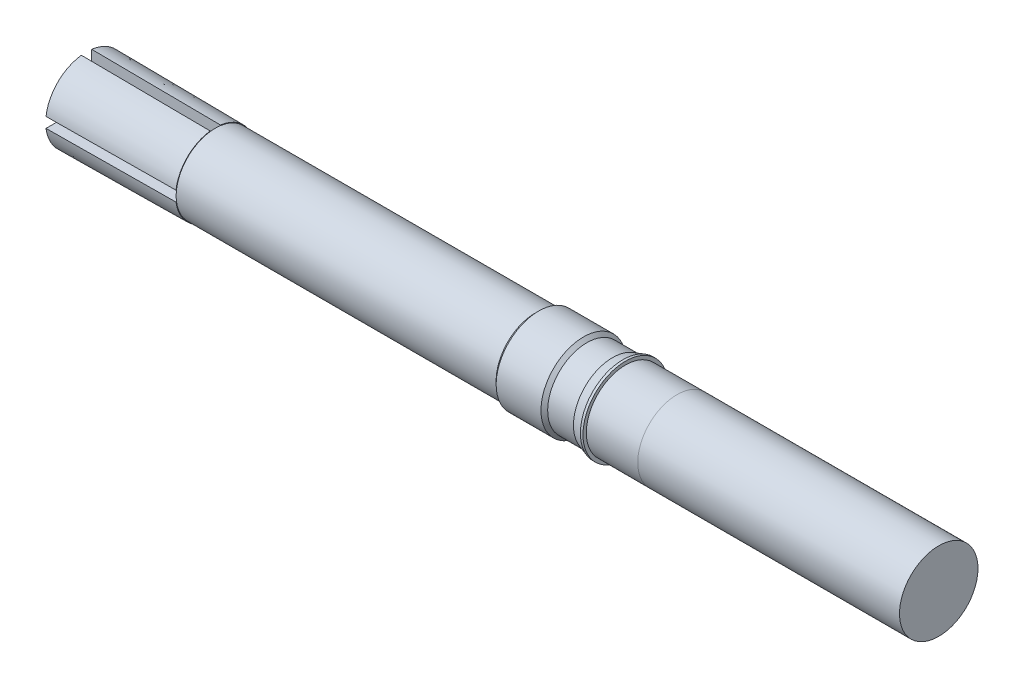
ISO-10303-21;
HEADER;
FILE_DESCRIPTION(('STEP AP214'),'2;1');
FILE_NAME('part.step','',(''),(''),'','','');
FILE_SCHEMA(('AUTOMOTIVE_DESIGN { 1 0 10303 214 1 1 1 1 }'));
ENDSEC;
DATA;
#1=APPLICATION_CONTEXT('core data for automotive mechanical design processes');
#2=APPLICATION_PROTOCOL_DEFINITION('international standard','automotive_design',2000,#1);
#3=PRODUCT_CONTEXT('',#1,'mechanical');
#4=PRODUCT('Part','Part','',(#3));
#5=PRODUCT_RELATED_PRODUCT_CATEGORY('part','',(#4));
#6=PRODUCT_DEFINITION_FORMATION('','',#4);
#7=PRODUCT_DEFINITION_CONTEXT('part definition',#1,'design');
#8=PRODUCT_DEFINITION('design','',#6,#7);
#9=PRODUCT_DEFINITION_SHAPE('','',#8);
#10=(LENGTH_UNIT() NAMED_UNIT(*) SI_UNIT(.MILLI.,.METRE.));
#11=(NAMED_UNIT(*) PLANE_ANGLE_UNIT() SI_UNIT($,.RADIAN.));
#12=(NAMED_UNIT(*) SI_UNIT($,.STERADIAN.) SOLID_ANGLE_UNIT());
#13=UNCERTAINTY_MEASURE_WITH_UNIT(LENGTH_MEASURE(1.E-05),#10,'distance_accuracy_value','');
#14=(GEOMETRIC_REPRESENTATION_CONTEXT(3) GLOBAL_UNCERTAINTY_ASSIGNED_CONTEXT((#13)) GLOBAL_UNIT_ASSIGNED_CONTEXT((#10,
#11,#12)) REPRESENTATION_CONTEXT('',''));
#15=CARTESIAN_POINT('',(0.,0.,0.));
#16=DIRECTION('',(0.,0.,1.));
#17=DIRECTION('',(1.,0.,0.));
#18=AXIS2_PLACEMENT_3D('',#15,#16,#17);
#19=CARTESIAN_POINT('',(10.9794,0.,0.));
#20=DIRECTION('',(-1.,0.,0.));
#21=DIRECTION('',(0.,-1.,0.));
#22=AXIS2_PLACEMENT_3D('',#19,#20,#21);
#23=PLANE('',#22);
#24=CARTESIAN_POINT('',(10.9794,0.,0.));
#25=DIRECTION('',(-1.,0.,0.));
#26=DIRECTION('',(0.,-1.,0.));
#27=AXIS2_PLACEMENT_3D('',#24,#25,#26);
#28=CIRCLE('',#27,1.52);
#29=CARTESIAN_POINT('',(10.9794,-0.199999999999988,1.50678465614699));
#30=VERTEX_POINT('',#29);
#31=CARTESIAN_POINT('',(10.9794,0.200000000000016,1.50678465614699));
#32=VERTEX_POINT('',#31);
#33=EDGE_CURVE('E227',#30,#32,#28,.T.);
#34=ORIENTED_EDGE('',*,*,#33,.T.);
#35=DIRECTION('',(0.,0.,1.));
#36=VECTOR('',#35,1.);
#37=CARTESIAN_POINT('',(10.9794,0.200000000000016,1.52695775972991));
#38=LINE('',#37,#36);
#39=CARTESIAN_POINT('',(10.9794,0.200000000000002,0.2));
#40=VERTEX_POINT('',#39);
#41=EDGE_CURVE('E57',#40,#32,#38,.T.);
#42=ORIENTED_EDGE('',*,*,#41,.F.);
#43=DIRECTION('',(0.,-1.,0.));
#44=VECTOR('',#43,1.);
#45=CARTESIAN_POINT('',(10.9794,0.200000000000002,0.2));
#46=LINE('',#45,#44);
#47=CARTESIAN_POINT('',(10.9794,1.50678465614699,0.2));
#48=VERTEX_POINT('',#47);
#49=EDGE_CURVE('E307',#48,#40,#46,.T.);
#50=ORIENTED_EDGE('',*,*,#49,.F.);
#51=CARTESIAN_POINT('',(10.9794,1.50678465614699,-0.2));
#52=VERTEX_POINT('',#51);
#53=EDGE_CURVE('E130',#48,#52,#28,.T.);
#54=ORIENTED_EDGE('',*,*,#53,.T.);
#55=DIRECTION('',(0.,1.,0.));
#56=VECTOR('',#55,1.);
#57=CARTESIAN_POINT('',(10.9794,1.52695775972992,-0.2));
#58=LINE('',#57,#56);
#59=CARTESIAN_POINT('',(10.9794,0.199999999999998,-0.2));
#60=VERTEX_POINT('',#59);
#61=EDGE_CURVE('E124',#60,#52,#58,.T.);
#62=ORIENTED_EDGE('',*,*,#61,.F.);
#63=DIRECTION('',(0.,0.,1.));
#64=VECTOR('',#63,1.);
#65=CARTESIAN_POINT('',(10.9794,0.199999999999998,-0.2));
#66=LINE('',#65,#64);
#67=CARTESIAN_POINT('',(10.9794,0.199999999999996,-1.50678465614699));
#68=VERTEX_POINT('',#67);
#69=EDGE_CURVE('E127',#68,#60,#66,.T.);
#70=ORIENTED_EDGE('',*,*,#69,.F.);
#71=CARTESIAN_POINT('',(10.9794,-0.200000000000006,-1.50678465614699));
#72=VERTEX_POINT('',#71);
#73=EDGE_CURVE('E327',#68,#72,#28,.T.);
#74=ORIENTED_EDGE('',*,*,#73,.T.);
#75=DIRECTION('',(0.,0.,-1.));
#76=VECTOR('',#75,1.);
#77=CARTESIAN_POINT('',(10.9794,-0.200000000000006,-1.52695775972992));
#78=LINE('',#77,#76);
#79=CARTESIAN_POINT('',(10.9794,-0.200000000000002,-0.2));
#80=VERTEX_POINT('',#79);
#81=EDGE_CURVE('E172',#80,#72,#78,.T.);
#82=ORIENTED_EDGE('',*,*,#81,.F.);
#83=DIRECTION('',(0.,1.,0.));
#84=VECTOR('',#83,1.);
#85=CARTESIAN_POINT('',(10.9794,-0.200000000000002,-0.2));
#86=LINE('',#85,#84);
#87=CARTESIAN_POINT('',(10.9794,-1.50678465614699,-0.2));
#88=VERTEX_POINT('',#87);
#89=EDGE_CURVE('E179',#88,#80,#86,.T.);
#90=ORIENTED_EDGE('',*,*,#89,.F.);
#91=CARTESIAN_POINT('',(10.9794,-1.50678465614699,0.2));
#92=VERTEX_POINT('',#91);
#93=EDGE_CURVE('E224',#88,#92,#28,.T.);
#94=ORIENTED_EDGE('',*,*,#93,.T.);
#95=DIRECTION('',(0.,-1.,0.));
#96=VECTOR('',#95,1.);
#97=CARTESIAN_POINT('',(10.9794,-1.52695775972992,0.2));
#98=LINE('',#97,#96);
#99=CARTESIAN_POINT('',(10.9794,-0.199999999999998,0.2));
#100=VERTEX_POINT('',#99);
#101=EDGE_CURVE('E103',#100,#92,#98,.T.);
#102=ORIENTED_EDGE('',*,*,#101,.F.);
#103=DIRECTION('',(0.,0.,-1.));
#104=VECTOR('',#103,1.);
#105=CARTESIAN_POINT('',(10.9794,-0.199999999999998,0.2));
#106=LINE('',#105,#104);
#107=EDGE_CURVE('E11',#30,#100,#106,.T.);
#108=ORIENTED_EDGE('',*,*,#107,.F.);
#109=EDGE_LOOP('',(#34,#42,#50,#54,#62,#70,#74,#82,#90,#94,#102,#108));
#110=FACE_BOUND('',#109,.T.);
#111=ADVANCED_FACE('F34',(#110),#23,.T.);
#112=CARTESIAN_POINT('',(28.9,0.,0.));
#113=DIRECTION('',(-1.,0.,0.));
#114=DIRECTION('',(0.,-1.,0.));
#115=AXIS2_PLACEMENT_3D('',#112,#113,#114);
#116=CYLINDRICAL_SURFACE('',#115,1.52);
#117=CARTESIAN_POINT('',(23.4,0.,0.));
#118=DIRECTION('',(-1.,0.,0.));
#119=DIRECTION('',(0.,-1.,0.));
#120=AXIS2_PLACEMENT_3D('',#117,#118,#119);
#121=CIRCLE('',#120,1.52);
#122=CARTESIAN_POINT('',(23.4,-1.52,0.));
#123=VERTEX_POINT('',#122);
#124=EDGE_CURVE('E221',#123,#123,#121,.T.);
#125=ORIENTED_EDGE('',*,*,#124,.T.);
#126=EDGE_LOOP('',(#125));
#127=FACE_BOUND('',#126,.T.);
#128=EDGE_CURVE('E47',#92,#30,#28,.T.);
#129=ORIENTED_EDGE('',*,*,#128,.F.);
#130=ORIENTED_EDGE('',*,*,#93,.F.);
#131=EDGE_CURVE('E329',#72,#88,#28,.T.);
#132=ORIENTED_EDGE('',*,*,#131,.F.);
#133=ORIENTED_EDGE('',*,*,#73,.F.);
#134=EDGE_CURVE('E322',#52,#68,#28,.T.);
#135=ORIENTED_EDGE('',*,*,#134,.F.);
#136=ORIENTED_EDGE('',*,*,#53,.F.);
#137=EDGE_CURVE('E328',#32,#48,#28,.T.);
#138=ORIENTED_EDGE('',*,*,#137,.F.);
#139=ORIENTED_EDGE('',*,*,#33,.F.);
#140=EDGE_LOOP('',(#129,#130,#132,#133,#135,#136,#138,#139));
#141=FACE_BOUND('',#140,.T.);
#142=ADVANCED_FACE('F426',(#127,#141),#116,.T.);
#143=CARTESIAN_POINT('',(23.4,0.,0.));
#144=DIRECTION('',(1.,0.,0.));
#145=DIRECTION('',(0.,1.,0.));
#146=AXIS2_PLACEMENT_3D('',#143,#144,#145);
#147=CONICAL_SURFACE('',#146,1.52,0.785398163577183);
#148=CARTESIAN_POINT('',(23.5299999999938,0.,0.));
#149=DIRECTION('',(-1.,0.,0.));
#150=DIRECTION('',(0.,-1.,0.));
#151=AXIS2_PLACEMENT_3D('',#148,#149,#150);
#152=CIRCLE('',#151,1.65000000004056);
#153=CARTESIAN_POINT('',(23.5299999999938,-1.65000000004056,0.));
#154=VERTEX_POINT('',#153);
#155=EDGE_CURVE('E218',#154,#154,#152,.T.);
#156=ORIENTED_EDGE('',*,*,#155,.T.);
#157=EDGE_LOOP('',(#156));
#158=FACE_BOUND('',#157,.T.);
#159=ORIENTED_EDGE('',*,*,#124,.F.);
#160=EDGE_LOOP('',(#159));
#161=FACE_BOUND('',#160,.T.);
#162=ADVANCED_FACE('F423',(#158,#161),#147,.T.);
#163=CARTESIAN_POINT('',(28.9,0.,0.));
#164=DIRECTION('',(-1.,0.,0.));
#165=DIRECTION('',(0.,-1.,0.));
#166=AXIS2_PLACEMENT_3D('',#163,#164,#165);
#167=CYLINDRICAL_SURFACE('',#166,1.65000000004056);
#168=CARTESIAN_POINT('',(25.27,0.,0.));
#169=DIRECTION('',(-1.,0.,0.));
#170=DIRECTION('',(0.,-1.,0.));
#171=AXIS2_PLACEMENT_3D('',#168,#169,#170);
#172=CIRCLE('',#171,1.65000000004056);
#173=CARTESIAN_POINT('',(25.27,-1.65000000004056,0.));
#174=VERTEX_POINT('',#173);
#175=EDGE_CURVE('E215',#174,#174,#172,.T.);
#176=ORIENTED_EDGE('',*,*,#175,.T.);
#177=EDGE_LOOP('',(#176));
#178=FACE_BOUND('',#177,.T.);
#179=ORIENTED_EDGE('',*,*,#155,.F.);
#180=EDGE_LOOP('',(#179));
#181=FACE_BOUND('',#180,.T.);
#182=ADVANCED_FACE('F419',(#178,#181),#167,.T.);
#183=CARTESIAN_POINT('',(25.27,0.,0.));
#184=DIRECTION('',(-1.,0.,0.));
#185=DIRECTION('',(0.,-1.,0.));
#186=AXIS2_PLACEMENT_3D('',#183,#184,#185);
#187=CONICAL_SURFACE('',#186,1.65000000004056,0.785398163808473);
#188=CARTESIAN_POINT('',(25.3999999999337,0.,0.));
#189=DIRECTION('',(-1.,0.,0.));
#190=DIRECTION('',(0.,-1.,0.));
#191=AXIS2_PLACEMENT_3D('',#188,#189,#190);
#192=CIRCLE('',#191,1.52);
#193=CARTESIAN_POINT('',(25.3999999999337,-1.52,0.));
#194=VERTEX_POINT('',#193);
#195=EDGE_CURVE('E212',#194,#194,#192,.T.);
#196=ORIENTED_EDGE('',*,*,#195,.T.);
#197=EDGE_LOOP('',(#196));
#198=FACE_BOUND('',#197,.T.);
#199=ORIENTED_EDGE('',*,*,#175,.F.);
#200=EDGE_LOOP('',(#199));
#201=FACE_BOUND('',#200,.T.);
#202=ADVANCED_FACE('F415',(#198,#201),#187,.T.);
#203=CARTESIAN_POINT('',(28.9,0.,0.));
#204=DIRECTION('',(-1.,0.,0.));
#205=DIRECTION('',(0.,-1.,0.));
#206=AXIS2_PLACEMENT_3D('',#203,#204,#205);
#207=CYLINDRICAL_SURFACE('',#206,1.52);
#208=CARTESIAN_POINT('',(26.4,0.,0.));
#209=DIRECTION('',(-1.,0.,0.));
#210=DIRECTION('',(0.,-1.,0.));
#211=AXIS2_PLACEMENT_3D('',#208,#209,#210);
#212=CIRCLE('',#211,1.52);
#213=CARTESIAN_POINT('',(26.4,-1.52,0.));
#214=VERTEX_POINT('',#213);
#215=EDGE_CURVE('E209',#214,#214,#212,.T.);
#216=ORIENTED_EDGE('',*,*,#215,.T.);
#217=EDGE_LOOP('',(#216));
#218=FACE_BOUND('',#217,.T.);
#219=ORIENTED_EDGE('',*,*,#195,.F.);
#220=EDGE_LOOP('',(#219));
#221=FACE_BOUND('',#220,.T.);
#222=ADVANCED_FACE('F411',(#218,#221),#207,.T.);
#223=CARTESIAN_POINT('',(26.4,0.,0.));
#224=DIRECTION('',(1.,0.,0.));
#225=DIRECTION('',(0.,1.,0.));
#226=AXIS2_PLACEMENT_3D('',#223,#224,#225);
#227=CONICAL_SURFACE('',#226,1.52,0.314231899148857);
#228=CARTESIAN_POINT('',(26.800000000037,0.,0.));
#229=DIRECTION('',(-1.,0.,0.));
#230=DIRECTION('',(0.,-1.,0.));
#231=AXIS2_PLACEMENT_3D('',#228,#229,#230);
#232=CIRCLE('',#231,1.65000000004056);
#233=CARTESIAN_POINT('',(26.800000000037,-1.65000000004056,0.));
#234=VERTEX_POINT('',#233);
#235=EDGE_CURVE('E206',#234,#234,#232,.T.);
#236=ORIENTED_EDGE('',*,*,#235,.T.);
#237=EDGE_LOOP('',(#236));
#238=FACE_BOUND('',#237,.T.);
#239=ORIENTED_EDGE('',*,*,#215,.F.);
#240=EDGE_LOOP('',(#239));
#241=FACE_BOUND('',#240,.T.);
#242=ADVANCED_FACE('F407',(#238,#241),#227,.T.);
#243=CARTESIAN_POINT('',(28.9,0.,0.));
#244=DIRECTION('',(-1.,0.,0.));
#245=DIRECTION('',(0.,-1.,0.));
#246=AXIS2_PLACEMENT_3D('',#243,#244,#245);
#247=CYLINDRICAL_SURFACE('',#246,1.65000000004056);
#248=CARTESIAN_POINT('',(26.9,0.,0.));
#249=DIRECTION('',(-1.,0.,0.));
#250=DIRECTION('',(0.,-1.,0.));
#251=AXIS2_PLACEMENT_3D('',#248,#249,#250);
#252=CIRCLE('',#251,1.65000000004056);
#253=CARTESIAN_POINT('',(26.9,-1.65000000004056,0.));
#254=VERTEX_POINT('',#253);
#255=EDGE_CURVE('E202',#254,#254,#252,.T.);
#256=ORIENTED_EDGE('',*,*,#255,.T.);
#257=EDGE_LOOP('',(#256));
#258=FACE_BOUND('',#257,.T.);
#259=ORIENTED_EDGE('',*,*,#235,.F.);
#260=EDGE_LOOP('',(#259));
#261=FACE_BOUND('',#260,.T.);
#262=ADVANCED_FACE('F403',(#258,#261),#247,.T.);
#263=CARTESIAN_POINT('',(26.9,1.65000000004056,0.));
#264=DIRECTION('',(1.,0.,0.));
#265=DIRECTION('',(0.,1.,0.));
#266=AXIS2_PLACEMENT_3D('',#263,#264,#265);
#267=PLANE('',#266);
#268=CARTESIAN_POINT('',(26.9,0.,0.));
#269=DIRECTION('',(-1.,0.,0.));
#270=DIRECTION('',(0.,-1.,0.));
#271=AXIS2_PLACEMENT_3D('',#268,#269,#270);
#272=CIRCLE('',#271,1.52);
#273=CARTESIAN_POINT('',(26.9,-1.52,0.));
#274=VERTEX_POINT('',#273);
#275=EDGE_CURVE('E199',#274,#274,#272,.T.);
#276=ORIENTED_EDGE('',*,*,#275,.T.);
#277=EDGE_LOOP('',(#276));
#278=FACE_BOUND('',#277,.T.);
#279=ORIENTED_EDGE('',*,*,#255,.F.);
#280=EDGE_LOOP('',(#279));
#281=FACE_BOUND('',#280,.T.);
#282=ADVANCED_FACE('F399',(#278,#281),#267,.T.);
#283=CARTESIAN_POINT('',(28.9,0.,0.));
#284=DIRECTION('',(-1.,0.,0.));
#285=DIRECTION('',(0.,-1.,0.));
#286=AXIS2_PLACEMENT_3D('',#283,#284,#285);
#287=CYLINDRICAL_SURFACE('',#286,1.52);
#288=CARTESIAN_POINT('',(28.9,0.,0.));
#289=DIRECTION('',(1.,0.,0.));
#290=DIRECTION('',(0.,0.,-1.));
#291=AXIS2_PLACEMENT_3D('',#288,#289,#290);
#292=CIRCLE('',#291,1.524);
#293=CARTESIAN_POINT('',(28.9,0.,-1.524));
#294=VERTEX_POINT('',#293);
#295=EDGE_CURVE('E688',#294,#294,#292,.T.);
#296=ORIENTED_EDGE('',*,*,#295,.F.);
#297=EDGE_LOOP('',(#296));
#298=FACE_BOUND('',#297,.T.);
#299=ORIENTED_EDGE('',*,*,#275,.F.);
#300=EDGE_LOOP('',(#299));
#301=FACE_BOUND('',#300,.T.);
#302=ADVANCED_FACE('F392',(#298,#301),#287,.T.);
#303=CARTESIAN_POINT('',(5.9794,-1.52695775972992,0.2));
#304=DIRECTION('',(0.,0.,1.));
#305=DIRECTION('',(0.,-1.,0.));
#306=AXIS2_PLACEMENT_3D('',#303,#304,#305);
#307=PLANE('',#306);
#308=ORIENTED_EDGE('',*,*,#101,.T.);
#309=CARTESIAN_POINT('',(10.9794,-1.52695775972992,0.2));
#310=VERTEX_POINT('',#309);
#311=EDGE_CURVE('E193',#92,#310,#98,.T.);
#312=ORIENTED_EDGE('',*,*,#311,.T.);
#313=CARTESIAN_POINT('',(10.9794,-1.52695775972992,0.2));
#314=CARTESIAN_POINT('',(9.96193246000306,-1.53619306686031,0.2));
#315=CARTESIAN_POINT('',(8.94446490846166,-1.54542710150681,0.2));
#316=CARTESIAN_POINT('',(3.85712709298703,-1.59159091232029,0.2));
#317=CARTESIAN_POINT('',(-0.212743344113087,-1.62850160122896,0.2));
#318=CARTESIAN_POINT('',(-4.28261396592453,-1.66539193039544,0.2));
#319=B_SPLINE_CURVE_WITH_KNOTS('',3,(#313,#314,#315,#316,#317,#318),.UNSPECIFIED.,.F.,.F.,(4,2,
4),(0.,3.05252835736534,15.2626417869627),.UNSPECIFIED.);
#320=CARTESIAN_POINT('',(5.9794,-1.57233107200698,0.2));
#321=VERTEX_POINT('',#320);
#322=EDGE_CURVE('E203',#321,#310,#319,.F.);
#323=ORIENTED_EDGE('',*,*,#322,.F.);
#324=DIRECTION('',(0.,-1.,0.));
#325=VECTOR('',#324,1.);
#326=CARTESIAN_POINT('',(5.9794,-1.52695775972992,0.2));
#327=LINE('',#326,#325);
#328=CARTESIAN_POINT('',(5.9794,-0.199999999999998,0.2));
#329=VERTEX_POINT('',#328);
#330=EDGE_CURVE('E185',#329,#321,#327,.T.);
#331=ORIENTED_EDGE('',*,*,#330,.F.);
#332=DIRECTION('',(1.,0.,0.));
#333=VECTOR('',#332,1.);
#334=CARTESIAN_POINT('',(5.9794,-0.199999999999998,0.2));
#335=LINE('',#334,#333);
#336=EDGE_CURVE('E190',#329,#100,#335,.T.);
#337=ORIENTED_EDGE('',*,*,#336,.T.);
#338=EDGE_LOOP('',(#308,#312,#323,#331,#337));
#339=FACE_BOUND('',#338,.T.);
#340=ADVANCED_FACE('F369',(#339),#307,.F.);
#341=CARTESIAN_POINT('',(10.9794,0.,0.));
#342=DIRECTION('',(-1.,0.,0.));
#343=DIRECTION('',(0.,0.,-1.));
#344=AXIS2_PLACEMENT_3D('',#341,#342,#343);
#345=CONICAL_SURFACE('',#344,1.53999999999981,0.00899975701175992);
#346=CARTESIAN_POINT('',(10.9794,0.,0.));
#347=DIRECTION('',(-1.,0.,0.));
#348=DIRECTION('',(0.,0.,-1.));
#349=AXIS2_PLACEMENT_3D('',#346,#347,#348);
#350=CIRCLE('',#349,1.53999999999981);
#351=CARTESIAN_POINT('',(10.9794,-0.199999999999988,1.52695775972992));
#352=VERTEX_POINT('',#351);
#353=EDGE_CURVE('E192',#310,#352,#350,.T.);
#354=ORIENTED_EDGE('',*,*,#353,.T.);
#355=CARTESIAN_POINT('',(5.9794,-0.199999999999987,1.57233107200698));
#356=CARTESIAN_POINT('',(7.02659877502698,-0.199999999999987,1.56283038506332));
#357=CARTESIAN_POINT('',(8.0737975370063,-0.199999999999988,1.55332826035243));
#358=CARTESIAN_POINT('',(9.74046419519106,-0.199999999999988,1.53820288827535));
#359=CARTESIAN_POINT('',(10.3599320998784,-0.199999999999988,1.53258057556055));
#360=CARTESIAN_POINT('',(10.9794,-0.199999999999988,1.52695775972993));
#361=B_SPLINE_CURVE_WITH_KNOTS('',3,(#355,#356,#357,#358,#359,#360),.UNSPECIFIED.,.F.,.F.,(4,2,
4),(0.,3.14172561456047,5.00020586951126),.UNSPECIFIED.);
#362=CARTESIAN_POINT('',(5.9794,-0.199999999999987,1.57233107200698));
#363=VERTEX_POINT('',#362);
#364=EDGE_CURVE('E198',#363,#352,#361,.T.);
#365=ORIENTED_EDGE('',*,*,#364,.F.);
#366=CARTESIAN_POINT('',(5.9794,0.,0.));
#367=DIRECTION('',(1.,0.,0.));
#368=DIRECTION('',(0.,0.,-1.));
#369=AXIS2_PLACEMENT_3D('',#366,#367,#368);
#370=CIRCLE('',#369,1.58499999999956);
#371=EDGE_CURVE('E94',#321,#363,#370,.F.);
#372=ORIENTED_EDGE('',*,*,#371,.F.);
#373=ORIENTED_EDGE('',*,*,#322,.T.);
#374=EDGE_LOOP('',(#354,#365,#372,#373));
#375=FACE_BOUND('',#374,.T.);
#376=ADVANCED_FACE('F36',(#375),#345,.T.);
#377=CARTESIAN_POINT('',(5.9794,-0.199999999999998,0.2));
#378=DIRECTION('',(0.,-1.,0.));
#379=DIRECTION('',(0.,0.,-1.));
#380=AXIS2_PLACEMENT_3D('',#377,#378,#379);
#381=PLANE('',#380);
#382=EDGE_CURVE('E49',#352,#30,#106,.T.);
#383=ORIENTED_EDGE('',*,*,#382,.T.);
#384=ORIENTED_EDGE('',*,*,#107,.T.);
#385=ORIENTED_EDGE('',*,*,#336,.F.);
#386=DIRECTION('',(0.,0.,-1.));
#387=VECTOR('',#386,1.);
#388=CARTESIAN_POINT('',(5.9794,-0.199999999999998,0.2));
#389=LINE('',#388,#387);
#390=EDGE_CURVE('E187',#363,#329,#389,.T.);
#391=ORIENTED_EDGE('',*,*,#390,.F.);
#392=ORIENTED_EDGE('',*,*,#364,.T.);
#393=EDGE_LOOP('',(#383,#384,#385,#391,#392));
#394=FACE_BOUND('',#393,.T.);
#395=ADVANCED_FACE('F393',(#394),#381,.F.);
#396=CARTESIAN_POINT('',(5.9794,0.,0.));
#397=DIRECTION('',(1.,0.,0.));
#398=DIRECTION('',(0.,0.,-1.));
#399=AXIS2_PLACEMENT_3D('',#396,#397,#398);
#400=PLANE('',#399);
#401=ORIENTED_EDGE('',*,*,#330,.T.);
#402=ORIENTED_EDGE('',*,*,#371,.T.);
#403=ORIENTED_EDGE('',*,*,#390,.T.);
#404=EDGE_LOOP('',(#401,#402,#403));
#405=FACE_BOUND('',#404,.T.);
#406=ADVANCED_FACE('F438',(#405),#400,.F.);
#407=CARTESIAN_POINT('',(10.9794,0.,0.));
#408=DIRECTION('',(1.,0.,0.));
#409=DIRECTION('',(0.,0.,-1.));
#410=AXIS2_PLACEMENT_3D('',#407,#408,#409);
#411=PLANE('',#410);
#412=ORIENTED_EDGE('',*,*,#311,.F.);
#413=ORIENTED_EDGE('',*,*,#128,.T.);
#414=ORIENTED_EDGE('',*,*,#382,.F.);
#415=ORIENTED_EDGE('',*,*,#353,.F.);
#416=EDGE_LOOP('',(#412,#413,#414,#415));
#417=FACE_BOUND('',#416,.T.);
#418=ADVANCED_FACE('F374',(#417),#411,.T.);
#419=CARTESIAN_POINT('',(5.9794,-0.200000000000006,-1.52695775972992));
#420=DIRECTION('',(0.,-1.,0.));
#421=DIRECTION('',(0.,0.,-1.));
#422=AXIS2_PLACEMENT_3D('',#419,#420,#421);
#423=PLANE('',#422);
#424=ORIENTED_EDGE('',*,*,#81,.T.);
#425=CARTESIAN_POINT('',(10.9794,-0.200000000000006,-1.52695775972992));
#426=VERTEX_POINT('',#425);
#427=EDGE_CURVE('E176',#72,#426,#78,.T.);
#428=ORIENTED_EDGE('',*,*,#427,.T.);
#429=CARTESIAN_POINT('',(10.9794,-0.200000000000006,-1.52695775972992));
#430=CARTESIAN_POINT('',(9.96193246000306,-0.200000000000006,-1.53619306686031));
#431=CARTESIAN_POINT('',(8.94446490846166,-0.200000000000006,-1.54542710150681));
#432=CARTESIAN_POINT('',(3.85712709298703,-0.200000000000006,-1.59159091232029));
#433=CARTESIAN_POINT('',(-0.212743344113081,-0.200000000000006,-1.62850160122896));
#434=CARTESIAN_POINT('',(-4.28261396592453,-0.200000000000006,-1.66539193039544));
#435=B_SPLINE_CURVE_WITH_KNOTS('',3,(#429,#430,#431,#432,#433,#434),.UNSPECIFIED.,.F.,.F.,(4,2,
4),(0.,3.05252835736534,15.2626417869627),.UNSPECIFIED.);
#436=CARTESIAN_POINT('',(5.9794,-0.200000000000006,-1.57233107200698));
#437=VERTEX_POINT('',#436);
#438=EDGE_CURVE('E372',#437,#426,#435,.F.);
#439=ORIENTED_EDGE('',*,*,#438,.F.);
#440=DIRECTION('',(0.,0.,-1.));
#441=VECTOR('',#440,1.);
#442=CARTESIAN_POINT('',(5.9794,-0.200000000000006,-1.52695775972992));
#443=LINE('',#442,#441);
#444=CARTESIAN_POINT('',(5.9794,-0.200000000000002,-0.2));
#445=VERTEX_POINT('',#444);
#446=EDGE_CURVE('E163',#445,#437,#443,.T.);
#447=ORIENTED_EDGE('',*,*,#446,.F.);
#448=DIRECTION('',(1.,0.,0.));
#449=VECTOR('',#448,1.);
#450=CARTESIAN_POINT('',(5.9794,-0.200000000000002,-0.2));
#451=LINE('',#450,#449);
#452=EDGE_CURVE('E171',#445,#80,#451,.T.);
#453=ORIENTED_EDGE('',*,*,#452,.T.);
#454=EDGE_LOOP('',(#424,#428,#439,#447,#453));
#455=FACE_BOUND('',#454,.T.);
#456=ADVANCED_FACE('F445',(#455),#423,.F.);
#457=CARTESIAN_POINT('',(10.9794,0.,0.));
#458=DIRECTION('',(-1.,0.,0.));
#459=DIRECTION('',(0.,0.,-1.));
#460=AXIS2_PLACEMENT_3D('',#457,#458,#459);
#461=CONICAL_SURFACE('',#460,1.53999999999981,0.00899975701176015);
#462=CARTESIAN_POINT('',(10.9794,0.,0.));
#463=DIRECTION('',(-1.,0.,0.));
#464=DIRECTION('',(0.,0.,-1.));
#465=AXIS2_PLACEMENT_3D('',#462,#463,#464);
#466=CIRCLE('',#465,1.53999999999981);
#467=CARTESIAN_POINT('',(10.9794,-1.52695775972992,-0.2));
#468=VERTEX_POINT('',#467);
#469=EDGE_CURVE('E175',#426,#468,#466,.T.);
#470=ORIENTED_EDGE('',*,*,#469,.T.);
#471=CARTESIAN_POINT('',(5.9794,-1.57233107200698,-0.2));
#472=CARTESIAN_POINT('',(7.02659877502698,-1.56283038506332,-0.2));
#473=CARTESIAN_POINT('',(8.0737975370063,-1.55332826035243,-0.2));
#474=CARTESIAN_POINT('',(9.74046419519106,-1.53820288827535,-0.2));
#475=CARTESIAN_POINT('',(10.3599320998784,-1.53258057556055,-0.2));
#476=CARTESIAN_POINT('',(10.9794,-1.52695775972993,-0.2));
#477=B_SPLINE_CURVE_WITH_KNOTS('',3,(#471,#472,#473,#474,#475,#476),.UNSPECIFIED.,.F.,.F.,(4,2,
4),(0.,3.14172561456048,5.00020586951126),.UNSPECIFIED.);
#478=CARTESIAN_POINT('',(5.9794,-1.57233107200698,-0.2));
#479=VERTEX_POINT('',#478);
#480=EDGE_CURVE('E184',#479,#468,#477,.T.);
#481=ORIENTED_EDGE('',*,*,#480,.F.);
#482=CARTESIAN_POINT('',(5.9794,0.,0.));
#483=DIRECTION('',(1.,0.,0.));
#484=DIRECTION('',(0.,0.,-1.));
#485=AXIS2_PLACEMENT_3D('',#482,#483,#484);
#486=CIRCLE('',#485,1.58499999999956);
#487=EDGE_CURVE('E166',#437,#479,#486,.F.);
#488=ORIENTED_EDGE('',*,*,#487,.F.);
#489=ORIENTED_EDGE('',*,*,#438,.T.);
#490=EDGE_LOOP('',(#470,#481,#488,#489));
#491=FACE_BOUND('',#490,.T.);
#492=ADVANCED_FACE('F449',(#491),#461,.T.);
#493=CARTESIAN_POINT('',(5.9794,-0.200000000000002,-0.2));
#494=DIRECTION('',(0.,0.,-1.));
#495=DIRECTION('',(0.,1.,0.));
#496=AXIS2_PLACEMENT_3D('',#493,#494,#495);
#497=PLANE('',#496);
#498=EDGE_CURVE('E167',#468,#88,#86,.T.);
#499=ORIENTED_EDGE('',*,*,#498,.T.);
#500=ORIENTED_EDGE('',*,*,#89,.T.);
#501=ORIENTED_EDGE('',*,*,#452,.F.);
#502=DIRECTION('',(0.,1.,0.));
#503=VECTOR('',#502,1.);
#504=CARTESIAN_POINT('',(5.9794,-0.200000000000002,-0.2));
#505=LINE('',#504,#503);
#506=EDGE_CURVE('E168',#479,#445,#505,.T.);
#507=ORIENTED_EDGE('',*,*,#506,.F.);
#508=ORIENTED_EDGE('',*,*,#480,.T.);
#509=EDGE_LOOP('',(#499,#500,#501,#507,#508));
#510=FACE_BOUND('',#509,.T.);
#511=ADVANCED_FACE('F451',(#510),#497,.F.);
#512=CARTESIAN_POINT('',(5.9794,0.,0.));
#513=DIRECTION('',(1.,0.,0.));
#514=DIRECTION('',(0.,0.,-1.));
#515=AXIS2_PLACEMENT_3D('',#512,#513,#514);
#516=PLANE('',#515);
#517=ORIENTED_EDGE('',*,*,#446,.T.);
#518=ORIENTED_EDGE('',*,*,#487,.T.);
#519=ORIENTED_EDGE('',*,*,#506,.T.);
#520=EDGE_LOOP('',(#517,#518,#519));
#521=FACE_BOUND('',#520,.T.);
#522=ADVANCED_FACE('F470',(#521),#516,.F.);
#523=CARTESIAN_POINT('',(10.9794,0.,0.));
#524=DIRECTION('',(1.,0.,0.));
#525=DIRECTION('',(0.,0.,-1.));
#526=AXIS2_PLACEMENT_3D('',#523,#524,#525);
#527=PLANE('',#526);
#528=ORIENTED_EDGE('',*,*,#427,.F.);
#529=ORIENTED_EDGE('',*,*,#131,.T.);
#530=ORIENTED_EDGE('',*,*,#498,.F.);
#531=ORIENTED_EDGE('',*,*,#469,.F.);
#532=EDGE_LOOP('',(#528,#529,#530,#531));
#533=FACE_BOUND('',#532,.T.);
#534=ADVANCED_FACE('F479',(#533),#527,.T.);
#535=CARTESIAN_POINT('',(5.9794,1.52695775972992,-0.2));
#536=DIRECTION('',(0.,0.,-1.));
#537=DIRECTION('',(0.,1.,0.));
#538=AXIS2_PLACEMENT_3D('',#535,#536,#537);
#539=PLANE('',#538);
#540=ORIENTED_EDGE('',*,*,#61,.T.);
#541=CARTESIAN_POINT('',(10.9794,1.52695775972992,-0.2));
#542=VERTEX_POINT('',#541);
#543=EDGE_CURVE('E136',#52,#542,#58,.T.);
#544=ORIENTED_EDGE('',*,*,#543,.T.);
#545=CARTESIAN_POINT('',(10.9794,1.52695775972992,-0.2));
#546=CARTESIAN_POINT('',(9.96193246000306,1.53619306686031,-0.2));
#547=CARTESIAN_POINT('',(8.94446490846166,1.54542710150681,-0.2));
#548=CARTESIAN_POINT('',(3.85712709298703,1.59159091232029,-0.2));
#549=CARTESIAN_POINT('',(-0.212743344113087,1.62850160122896,-0.2));
#550=CARTESIAN_POINT('',(-4.28261396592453,1.66539193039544,-0.2));
#551=B_SPLINE_CURVE_WITH_KNOTS('',3,(#545,#546,#547,#548,#549,#550),.UNSPECIFIED.,.F.,.F.,(4,2,
4),(0.,3.05252835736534,15.2626417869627),.UNSPECIFIED.);
#552=CARTESIAN_POINT('',(5.9794,1.57233107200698,-0.2));
#553=VERTEX_POINT('',#552);
#554=EDGE_CURVE('E156',#553,#542,#551,.F.);
#555=ORIENTED_EDGE('',*,*,#554,.F.);
#556=DIRECTION('',(0.,1.,0.));
#557=VECTOR('',#556,1.);
#558=CARTESIAN_POINT('',(5.9794,1.52695775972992,-0.2));
#559=LINE('',#558,#557);
#560=CARTESIAN_POINT('',(5.9794,0.199999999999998,-0.2));
#561=VERTEX_POINT('',#560);
#562=EDGE_CURVE('E152',#561,#553,#559,.T.);
#563=ORIENTED_EDGE('',*,*,#562,.F.);
#564=DIRECTION('',(1.,0.,0.));
#565=VECTOR('',#564,1.);
#566=CARTESIAN_POINT('',(5.9794,0.199999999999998,-0.2));
#567=LINE('',#566,#565);
#568=EDGE_CURVE('E143',#561,#60,#567,.T.);
#569=ORIENTED_EDGE('',*,*,#568,.T.);
#570=EDGE_LOOP('',(#540,#544,#555,#563,#569));
#571=FACE_BOUND('',#570,.T.);
#572=ADVANCED_FACE('F149',(#571),#539,.F.);
#573=CARTESIAN_POINT('',(10.9794,0.,0.));
#574=DIRECTION('',(-1.,0.,0.));
#575=DIRECTION('',(0.,0.,-1.));
#576=AXIS2_PLACEMENT_3D('',#573,#574,#575);
#577=CONICAL_SURFACE('',#576,1.53999999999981,0.00899975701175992);
#578=CARTESIAN_POINT('',(10.9794,0.,0.));
#579=DIRECTION('',(-1.,0.,0.));
#580=DIRECTION('',(0.,0.,-1.));
#581=AXIS2_PLACEMENT_3D('',#578,#579,#580);
#582=CIRCLE('',#581,1.53999999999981);
#583=CARTESIAN_POINT('',(10.9794,0.199999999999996,-1.52695775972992));
#584=VERTEX_POINT('',#583);
#585=EDGE_CURVE('E135',#542,#584,#582,.T.);
#586=ORIENTED_EDGE('',*,*,#585,.T.);
#587=CARTESIAN_POINT('',(5.9794,0.199999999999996,-1.57233107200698));
#588=CARTESIAN_POINT('',(7.02659877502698,0.199999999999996,-1.56283038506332));
#589=CARTESIAN_POINT('',(8.0737975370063,0.199999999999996,-1.55332826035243));
#590=CARTESIAN_POINT('',(9.74046419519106,0.199999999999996,-1.53820288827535));
#591=CARTESIAN_POINT('',(10.3599320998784,0.199999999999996,-1.53258057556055));
#592=CARTESIAN_POINT('',(10.9794,0.199999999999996,-1.52695775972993));
#593=B_SPLINE_CURVE_WITH_KNOTS('',3,(#587,#588,#589,#590,#591,#592),.UNSPECIFIED.,.F.,.F.,(4,2,
4),(0.,3.14172561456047,5.00020586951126),.UNSPECIFIED.);
#594=CARTESIAN_POINT('',(5.9794,0.199999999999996,-1.57233107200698));
#595=VERTEX_POINT('',#594);
#596=EDGE_CURVE('E153',#595,#584,#593,.T.);
#597=ORIENTED_EDGE('',*,*,#596,.F.);
#598=CARTESIAN_POINT('',(5.9794,0.,0.));
#599=DIRECTION('',(1.,0.,0.));
#600=DIRECTION('',(0.,0.,-1.));
#601=AXIS2_PLACEMENT_3D('',#598,#599,#600);
#602=CIRCLE('',#601,1.58499999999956);
#603=EDGE_CURVE('E159',#553,#595,#602,.F.);
#604=ORIENTED_EDGE('',*,*,#603,.F.);
#605=ORIENTED_EDGE('',*,*,#554,.T.);
#606=EDGE_LOOP('',(#586,#597,#604,#605));
#607=FACE_BOUND('',#606,.T.);
#608=ADVANCED_FACE('F251',(#607),#577,.T.);
#609=CARTESIAN_POINT('',(5.9794,0.199999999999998,-0.2));
#610=DIRECTION('',(0.,1.,0.));
#611=DIRECTION('',(0.,0.,1.));
#612=AXIS2_PLACEMENT_3D('',#609,#610,#611);
#613=PLANE('',#612);
#614=EDGE_CURVE('E147',#584,#68,#66,.T.);
#615=ORIENTED_EDGE('',*,*,#614,.T.);
#616=ORIENTED_EDGE('',*,*,#69,.T.);
#617=ORIENTED_EDGE('',*,*,#568,.F.);
#618=DIRECTION('',(0.,0.,1.));
#619=VECTOR('',#618,1.);
#620=CARTESIAN_POINT('',(5.9794,0.199999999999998,-0.2));
#621=LINE('',#620,#619);
#622=EDGE_CURVE('E154',#595,#561,#621,.T.);
#623=ORIENTED_EDGE('',*,*,#622,.F.);
#624=ORIENTED_EDGE('',*,*,#596,.T.);
#625=EDGE_LOOP('',(#615,#616,#617,#623,#624));
#626=FACE_BOUND('',#625,.T.);
#627=ADVANCED_FACE('F141',(#626),#613,.F.);
#628=CARTESIAN_POINT('',(5.9794,0.,0.));
#629=DIRECTION('',(1.,0.,0.));
#630=DIRECTION('',(0.,0.,-1.));
#631=AXIS2_PLACEMENT_3D('',#628,#629,#630);
#632=PLANE('',#631);
#633=ORIENTED_EDGE('',*,*,#562,.T.);
#634=ORIENTED_EDGE('',*,*,#603,.T.);
#635=ORIENTED_EDGE('',*,*,#622,.T.);
#636=EDGE_LOOP('',(#633,#634,#635));
#637=FACE_BOUND('',#636,.T.);
#638=ADVANCED_FACE('F491',(#637),#632,.F.);
#639=CARTESIAN_POINT('',(10.9794,0.,0.));
#640=DIRECTION('',(1.,0.,0.));
#641=DIRECTION('',(0.,0.,-1.));
#642=AXIS2_PLACEMENT_3D('',#639,#640,#641);
#643=PLANE('',#642);
#644=ORIENTED_EDGE('',*,*,#543,.F.);
#645=ORIENTED_EDGE('',*,*,#134,.T.);
#646=ORIENTED_EDGE('',*,*,#614,.F.);
#647=ORIENTED_EDGE('',*,*,#585,.F.);
#648=EDGE_LOOP('',(#644,#645,#646,#647));
#649=FACE_BOUND('',#648,.T.);
#650=ADVANCED_FACE('F321',(#649),#643,.T.);
#651=CARTESIAN_POINT('',(5.9794,0.200000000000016,1.52695775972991));
#652=DIRECTION('',(0.,1.,0.));
#653=DIRECTION('',(0.,0.,1.));
#654=AXIS2_PLACEMENT_3D('',#651,#652,#653);
#655=PLANE('',#654);
#656=ORIENTED_EDGE('',*,*,#41,.T.);
#657=CARTESIAN_POINT('',(10.9794,0.200000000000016,1.52695775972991));
#658=VERTEX_POINT('',#657);
#659=EDGE_CURVE('E304',#32,#658,#38,.T.);
#660=ORIENTED_EDGE('',*,*,#659,.T.);
#661=CARTESIAN_POINT('',(10.9794,0.200000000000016,1.52695775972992));
#662=CARTESIAN_POINT('',(9.96193246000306,0.200000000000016,1.53619306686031));
#663=CARTESIAN_POINT('',(8.94446490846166,0.200000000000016,1.54542710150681));
#664=CARTESIAN_POINT('',(3.85712709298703,0.200000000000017,1.59159091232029));
#665=CARTESIAN_POINT('',(-0.212743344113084,0.200000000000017,1.62850160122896));
#666=CARTESIAN_POINT('',(-4.28261396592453,0.200000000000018,1.66539193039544));
#667=B_SPLINE_CURVE_WITH_KNOTS('',3,(#661,#662,#663,#664,#665,#666),.UNSPECIFIED.,.F.,.F.,(4,2,
4),(0.,3.05252835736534,15.2626417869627),.UNSPECIFIED.);
#668=CARTESIAN_POINT('',(5.9794,0.200000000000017,1.57233107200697));
#669=VERTEX_POINT('',#668);
#670=EDGE_CURVE('E228',#669,#658,#667,.F.);
#671=ORIENTED_EDGE('',*,*,#670,.F.);
#672=DIRECTION('',(0.,0.,1.));
#673=VECTOR('',#672,1.);
#674=CARTESIAN_POINT('',(5.9794,0.200000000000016,1.52695775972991));
#675=LINE('',#674,#673);
#676=CARTESIAN_POINT('',(5.9794,0.200000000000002,0.2));
#677=VERTEX_POINT('',#676);
#678=EDGE_CURVE('E290',#677,#669,#675,.T.);
#679=ORIENTED_EDGE('',*,*,#678,.F.);
#680=DIRECTION('',(1.,0.,0.));
#681=VECTOR('',#680,1.);
#682=CARTESIAN_POINT('',(5.9794,0.200000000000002,0.2));
#683=LINE('',#682,#681);
#684=EDGE_CURVE('E259',#677,#40,#683,.T.);
#685=ORIENTED_EDGE('',*,*,#684,.T.);
#686=EDGE_LOOP('',(#656,#660,#671,#679,#685));
#687=FACE_BOUND('',#686,.T.);
#688=ADVANCED_FACE('F239',(#687),#655,.F.);
#689=CARTESIAN_POINT('',(10.9794,0.,0.));
#690=DIRECTION('',(-1.,0.,0.));
#691=DIRECTION('',(0.,0.,-1.));
#692=AXIS2_PLACEMENT_3D('',#689,#690,#691);
#693=CONICAL_SURFACE('',#692,1.53999999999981,0.00899975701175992);
#694=CARTESIAN_POINT('',(10.9794,0.,0.));
#695=DIRECTION('',(-1.,0.,0.));
#696=DIRECTION('',(0.,0.,-1.));
#697=AXIS2_PLACEMENT_3D('',#694,#695,#696);
#698=CIRCLE('',#697,1.53999999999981);
#699=CARTESIAN_POINT('',(10.9794,1.52695775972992,0.2));
#700=VERTEX_POINT('',#699);
#701=EDGE_CURVE('E303',#658,#700,#698,.T.);
#702=ORIENTED_EDGE('',*,*,#701,.T.);
#703=CARTESIAN_POINT('',(5.9794,1.57233107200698,0.2));
#704=CARTESIAN_POINT('',(7.02659877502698,1.56283038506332,0.2));
#705=CARTESIAN_POINT('',(8.0737975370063,1.55332826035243,0.2));
#706=CARTESIAN_POINT('',(9.74046419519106,1.53820288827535,0.2));
#707=CARTESIAN_POINT('',(10.3599320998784,1.53258057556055,0.2));
#708=CARTESIAN_POINT('',(10.9794,1.52695775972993,0.2));
#709=B_SPLINE_CURVE_WITH_KNOTS('',3,(#703,#704,#705,#706,#707,#708),.UNSPECIFIED.,.F.,.F.,(4,2,
4),(0.,3.14172561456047,5.00020586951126),.UNSPECIFIED.);
#710=CARTESIAN_POINT('',(5.9794,1.57233107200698,0.2));
#711=VERTEX_POINT('',#710);
#712=EDGE_CURVE('E236',#711,#700,#709,.T.);
#713=ORIENTED_EDGE('',*,*,#712,.F.);
#714=CARTESIAN_POINT('',(5.9794,0.,0.));
#715=DIRECTION('',(1.,0.,0.));
#716=DIRECTION('',(0.,0.,-1.));
#717=AXIS2_PLACEMENT_3D('',#714,#715,#716);
#718=CIRCLE('',#717,1.58499999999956);
#719=EDGE_CURVE('E237',#669,#711,#718,.F.);
#720=ORIENTED_EDGE('',*,*,#719,.F.);
#721=ORIENTED_EDGE('',*,*,#670,.T.);
#722=EDGE_LOOP('',(#702,#713,#720,#721));
#723=FACE_BOUND('',#722,.T.);
#724=ADVANCED_FACE('F243',(#723),#693,.T.);
#725=CARTESIAN_POINT('',(5.9794,0.200000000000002,0.2));
#726=DIRECTION('',(0.,0.,1.));
#727=DIRECTION('',(0.,-1.,0.));
#728=AXIS2_PLACEMENT_3D('',#725,#726,#727);
#729=PLANE('',#728);
#730=EDGE_CURVE('E298',#700,#48,#46,.T.);
#731=ORIENTED_EDGE('',*,*,#730,.T.);
#732=ORIENTED_EDGE('',*,*,#49,.T.);
#733=ORIENTED_EDGE('',*,*,#684,.F.);
#734=DIRECTION('',(0.,-1.,0.));
#735=VECTOR('',#734,1.);
#736=CARTESIAN_POINT('',(5.9794,0.200000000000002,0.2));
#737=LINE('',#736,#735);
#738=EDGE_CURVE('E299',#711,#677,#737,.T.);
#739=ORIENTED_EDGE('',*,*,#738,.F.);
#740=ORIENTED_EDGE('',*,*,#712,.T.);
#741=EDGE_LOOP('',(#731,#732,#733,#739,#740));
#742=FACE_BOUND('',#741,.T.);
#743=ADVANCED_FACE('F248',(#742),#729,.F.);
#744=CARTESIAN_POINT('',(5.9794,0.,0.));
#745=DIRECTION('',(1.,0.,0.));
#746=DIRECTION('',(0.,0.,-1.));
#747=AXIS2_PLACEMENT_3D('',#744,#745,#746);
#748=PLANE('',#747);
#749=ORIENTED_EDGE('',*,*,#678,.T.);
#750=ORIENTED_EDGE('',*,*,#719,.T.);
#751=ORIENTED_EDGE('',*,*,#738,.T.);
#752=EDGE_LOOP('',(#749,#750,#751));
#753=FACE_BOUND('',#752,.T.);
#754=ADVANCED_FACE('F268',(#753),#748,.F.);
#755=CARTESIAN_POINT('',(10.9794,0.,0.));
#756=DIRECTION('',(1.,0.,0.));
#757=DIRECTION('',(0.,0.,-1.));
#758=AXIS2_PLACEMENT_3D('',#755,#756,#757);
#759=PLANE('',#758);
#760=ORIENTED_EDGE('',*,*,#659,.F.);
#761=ORIENTED_EDGE('',*,*,#137,.T.);
#762=ORIENTED_EDGE('',*,*,#730,.F.);
#763=ORIENTED_EDGE('',*,*,#701,.F.);
#764=EDGE_LOOP('',(#760,#761,#762,#763));
#765=FACE_BOUND('',#764,.T.);
#766=ADVANCED_FACE('F270',(#765),#759,.T.);
#767=CARTESIAN_POINT('',(39.06,0.,0.));
#768=DIRECTION('',(-1.,0.,0.));
#769=DIRECTION('',(0.,0.,1.));
#770=AXIS2_PLACEMENT_3D('',#767,#768,#769);
#771=CYLINDRICAL_SURFACE('',#770,1.524);
#772=CARTESIAN_POINT('',(39.06,0.,0.));
#773=DIRECTION('',(1.,0.,0.));
#774=DIRECTION('',(0.,0.,-1.));
#775=AXIS2_PLACEMENT_3D('',#772,#773,#774);
#776=CIRCLE('',#775,1.524);
#777=CARTESIAN_POINT('',(39.06,0.,-1.524));
#778=VERTEX_POINT('',#777);
#779=EDGE_CURVE('E687',#778,#778,#776,.T.);
#780=ORIENTED_EDGE('',*,*,#779,.F.);
#781=EDGE_LOOP('',(#780));
#782=FACE_BOUND('',#781,.T.);
#783=ORIENTED_EDGE('',*,*,#295,.T.);
#784=EDGE_LOOP('',(#783));
#785=FACE_BOUND('',#784,.T.);
#786=ADVANCED_FACE('F273',(#782,#785),#771,.T.);
#787=CARTESIAN_POINT('',(39.06,0.,0.));
#788=DIRECTION('',(1.,0.,0.));
#789=DIRECTION('',(0.,0.,-1.));
#790=AXIS2_PLACEMENT_3D('',#787,#788,#789);
#791=PLANE('',#790);
#792=ORIENTED_EDGE('',*,*,#779,.T.);
#793=EDGE_LOOP('',(#792));
#794=FACE_BOUND('',#793,.T.);
#795=ADVANCED_FACE('F281',(#794),#791,.T.);
#796=CLOSED_SHELL('',(#111,#142,#162,#182,#202,#222,#242,#262,#282,#302,#340,#376,#395,#406,
#418,#456,#492,#511,#522,#534,#572,#608,#627,#638,#650,#688,#724,#743,#754,#766,#786,#795));
#797=MANIFOLD_SOLID_BREP('B2',#796);
#798=ADVANCED_BREP_SHAPE_REPRESENTATION('',(#18,#797),#14);
#799=SHAPE_DEFINITION_REPRESENTATION(#9,#798);
ENDSEC;
END-ISO-10303-21;
